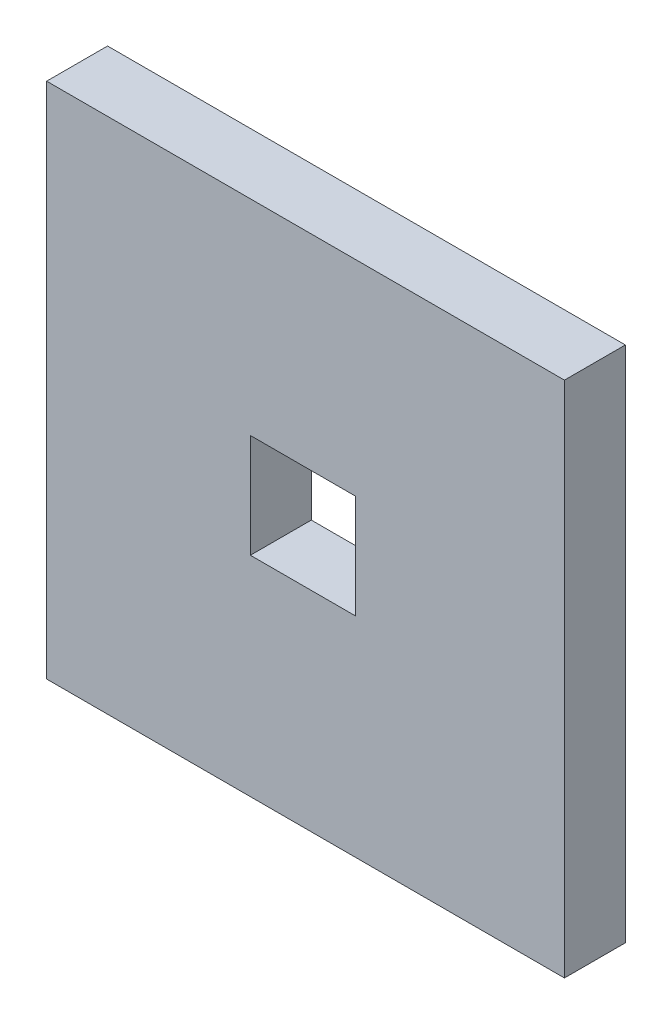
ISO-10303-21;
HEADER;
FILE_DESCRIPTION(('STEP AP214'),'2;1');
FILE_NAME('part.step','',(''),(''),'','','');
FILE_SCHEMA(('AUTOMOTIVE_DESIGN { 1 0 10303 214 1 1 1 1 }'));
ENDSEC;
DATA;
#1=APPLICATION_CONTEXT('core data for automotive mechanical design processes');
#2=APPLICATION_PROTOCOL_DEFINITION('international standard','automotive_design',2000,#1);
#3=PRODUCT_CONTEXT('',#1,'mechanical');
#4=PRODUCT('Part','Part','',(#3));
#5=PRODUCT_RELATED_PRODUCT_CATEGORY('part','',(#4));
#6=PRODUCT_DEFINITION_FORMATION('','',#4);
#7=PRODUCT_DEFINITION_CONTEXT('part definition',#1,'design');
#8=PRODUCT_DEFINITION('design','',#6,#7);
#9=PRODUCT_DEFINITION_SHAPE('','',#8);
#10=(LENGTH_UNIT() NAMED_UNIT(*) SI_UNIT(.MILLI.,.METRE.));
#11=(NAMED_UNIT(*) PLANE_ANGLE_UNIT() SI_UNIT($,.RADIAN.));
#12=(NAMED_UNIT(*) SI_UNIT($,.STERADIAN.) SOLID_ANGLE_UNIT());
#13=UNCERTAINTY_MEASURE_WITH_UNIT(LENGTH_MEASURE(1.E-05),#10,'distance_accuracy_value','');
#14=(GEOMETRIC_REPRESENTATION_CONTEXT(3) GLOBAL_UNCERTAINTY_ASSIGNED_CONTEXT((#13)) GLOBAL_UNIT_ASSIGNED_CONTEXT((#10,
#11,#12)) REPRESENTATION_CONTEXT('',''));
#15=CARTESIAN_POINT('',(0.,0.,0.));
#16=DIRECTION('',(0.,0.,1.));
#17=DIRECTION('',(1.,0.,0.));
#18=AXIS2_PLACEMENT_3D('',#15,#16,#17);
#19=CARTESIAN_POINT('',(-30.6892269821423,0.,99.1665222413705));
#20=DIRECTION('',(1.,0.,0.));
#21=DIRECTION('',(0.,0.,-1.));
#22=AXIS2_PLACEMENT_3D('',#19,#20,#21);
#23=PLANE('',#22);
#24=DIRECTION('',(0.,-1.,0.));
#25=VECTOR('',#24,1.);
#26=CARTESIAN_POINT('',(-30.6892269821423,0.,-5.));
#27=LINE('',#26,#25);
#28=CARTESIAN_POINT('',(-30.6892269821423,-6.80242147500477,-5.));
#29=VERTEX_POINT('',#28);
#30=CARTESIAN_POINT('',(-30.6892269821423,-22.696210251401,-5.));
#31=VERTEX_POINT('',#30);
#32=EDGE_CURVE('E99',#29,#31,#27,.T.);
#33=ORIENTED_EDGE('',*,*,#32,.T.);
#34=DIRECTION('',(0.,0.,1.));
#35=VECTOR('',#34,1.);
#36=CARTESIAN_POINT('',(-30.6892269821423,-22.696210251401,-7.23331795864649));
#37=LINE('',#36,#35);
#38=CARTESIAN_POINT('',(-30.6892269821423,-22.696210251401,0.));
#39=VERTEX_POINT('',#38);
#40=EDGE_CURVE('E315',#31,#39,#37,.T.);
#41=ORIENTED_EDGE('',*,*,#40,.T.);
#42=DIRECTION('',(0.,-1.,0.));
#43=VECTOR('',#42,1.);
#44=CARTESIAN_POINT('',(-30.6892269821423,0.,0.));
#45=LINE('',#44,#43);
#46=CARTESIAN_POINT('',(-30.6892269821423,12.2508497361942,0.));
#47=VERTEX_POINT('',#46);
#48=EDGE_CURVE('E484',#47,#39,#45,.T.);
#49=ORIENTED_EDGE('',*,*,#48,.F.);
#50=DIRECTION('',(0.,0.,1.));
#51=VECTOR('',#50,1.);
#52=CARTESIAN_POINT('',(-30.6892269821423,12.2508497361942,-0.29));
#53=LINE('',#52,#51);
#54=CARTESIAN_POINT('',(-30.6892269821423,12.2508497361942,-0.29));
#55=VERTEX_POINT('',#54);
#56=EDGE_CURVE('E407',#55,#47,#53,.T.);
#57=ORIENTED_EDGE('',*,*,#56,.F.);
#58=DIRECTION('',(0.,1.,0.));
#59=VECTOR('',#58,1.);
#60=CARTESIAN_POINT('',(-30.6892269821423,0.,-0.29));
#61=LINE('',#60,#59);
#62=CARTESIAN_POINT('',(-30.6892269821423,-6.80242147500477,-0.29));
#63=VERTEX_POINT('',#62);
#64=EDGE_CURVE('E398',#63,#55,#61,.T.);
#65=ORIENTED_EDGE('',*,*,#64,.F.);
#66=DIRECTION('',(0.,0.,-1.));
#67=VECTOR('',#66,1.);
#68=CARTESIAN_POINT('',(-30.6892269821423,-6.80242147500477,99.1665222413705));
#69=LINE('',#68,#67);
#70=EDGE_CURVE('E449',#63,#29,#69,.T.);
#71=ORIENTED_EDGE('',*,*,#70,.T.);
#72=EDGE_LOOP('',(#33,#41,#49,#57,#65,#71));
#73=FACE_BOUND('',#72,.T.);
#74=ADVANCED_FACE('F84',(#73),#23,.F.);
#75=CARTESIAN_POINT('',(0.,-6.80242147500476,99.1665222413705));
#76=DIRECTION('',(0.,-1.,0.));
#77=DIRECTION('',(1.,0.,0.));
#78=AXIS2_PLACEMENT_3D('',#75,#76,#77);
#79=PLANE('',#78);
#80=DIRECTION('',(0.,0.,1.));
#81=VECTOR('',#80,1.);
#82=CARTESIAN_POINT('',(-11.2004568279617,-6.8024214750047,-7.23331795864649));
#83=LINE('',#82,#81);
#84=CARTESIAN_POINT('',(-11.2004568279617,-6.80242147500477,-5.));
#85=VERTEX_POINT('',#84);
#86=CARTESIAN_POINT('',(-11.2004568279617,-6.8024214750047,-0.29));
#87=VERTEX_POINT('',#86);
#88=EDGE_CURVE('E318',#85,#87,#83,.T.);
#89=ORIENTED_EDGE('',*,*,#88,.T.);
#90=DIRECTION('',(-1.,0.,0.));
#91=VECTOR('',#90,1.);
#92=CARTESIAN_POINT('',(0.,-6.80242147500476,-0.29));
#93=LINE('',#92,#91);
#94=CARTESIAN_POINT('',(-9.19922698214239,-6.80242147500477,-0.29));
#95=VERTEX_POINT('',#94);
#96=EDGE_CURVE('E401',#95,#87,#93,.T.);
#97=ORIENTED_EDGE('',*,*,#96,.F.);
#98=DIRECTION('',(0.,0.,-1.));
#99=VECTOR('',#98,1.);
#100=CARTESIAN_POINT('',(-9.19922698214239,-6.80242147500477,99.1665222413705));
#101=LINE('',#100,#99);
#102=CARTESIAN_POINT('',(-9.19922698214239,-6.80242147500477,-5.));
#103=VERTEX_POINT('',#102);
#104=EDGE_CURVE('E451',#95,#103,#101,.T.);
#105=ORIENTED_EDGE('',*,*,#104,.T.);
#106=DIRECTION('',(-1.,0.,0.));
#107=VECTOR('',#106,1.);
#108=CARTESIAN_POINT('',(0.,-6.80242147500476,-5.));
#109=LINE('',#108,#107);
#110=EDGE_CURVE('E307',#103,#85,#109,.T.);
#111=ORIENTED_EDGE('',*,*,#110,.T.);
#112=EDGE_LOOP('',(#89,#97,#105,#111));
#113=FACE_BOUND('',#112,.T.);
#114=ADVANCED_FACE('F581',(#113),#79,.F.);
#115=DIRECTION('',(0.,0.,1.));
#116=VECTOR('',#115,1.);
#117=CARTESIAN_POINT('',(-13.1979971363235,-6.8024214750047,-7.23331795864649));
#118=LINE('',#117,#116);
#119=CARTESIAN_POINT('',(-13.1979971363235,-6.80242147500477,-5.));
#120=VERTEX_POINT('',#119);
#121=CARTESIAN_POINT('',(-13.1979971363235,-6.80242147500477,-0.29));
#122=VERTEX_POINT('',#121);
#123=EDGE_CURVE('E321',#120,#122,#118,.T.);
#124=ORIENTED_EDGE('',*,*,#123,.F.);
#125=EDGE_CURVE('E443',#120,#29,#109,.T.);
#126=ORIENTED_EDGE('',*,*,#125,.T.);
#127=ORIENTED_EDGE('',*,*,#70,.F.);
#128=EDGE_CURVE('E400',#122,#63,#93,.T.);
#129=ORIENTED_EDGE('',*,*,#128,.F.);
#130=EDGE_LOOP('',(#124,#126,#127,#129));
#131=FACE_BOUND('',#130,.T.);
#132=ADVANCED_FACE('F589',(#131),#79,.F.);
#133=CARTESIAN_POINT('',(0.,0.,-0.29));
#134=DIRECTION('',(0.,0.,1.));
#135=DIRECTION('',(1.,0.,0.));
#136=AXIS2_PLACEMENT_3D('',#133,#134,#135);
#137=PLANE('',#136);
#138=CARTESIAN_POINT('',(-12.1992269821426,-6.8024214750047,-0.29));
#139=DIRECTION('',(0.,0.,1.));
#140=DIRECTION('',(1.,0.,0.));
#141=AXIS2_PLACEMENT_3D('',#138,#139,#140);
#142=CIRCLE('',#141,0.998770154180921);
#143=EDGE_CURVE('E12',#122,#87,#142,.F.);
#144=ORIENTED_EDGE('',*,*,#143,.F.);
#145=ORIENTED_EDGE('',*,*,#128,.T.);
#146=ORIENTED_EDGE('',*,*,#64,.T.);
#147=DIRECTION('',(1.,0.,0.));
#148=VECTOR('',#147,1.);
#149=CARTESIAN_POINT('',(0.,12.2508497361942,-0.29));
#150=LINE('',#149,#148);
#151=CARTESIAN_POINT('',(10.3708614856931,12.2508497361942,-0.29));
#152=VERTEX_POINT('',#151);
#153=EDGE_CURVE('E395',#55,#152,#150,.T.);
#154=ORIENTED_EDGE('',*,*,#153,.T.);
#155=DIRECTION('',(0.,-1.,0.));
#156=VECTOR('',#155,1.);
#157=CARTESIAN_POINT('',(10.3708614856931,7.25084973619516,-0.29));
#158=LINE('',#157,#156);
#159=CARTESIAN_POINT('',(10.3708614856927,7.25084973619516,-0.29));
#160=VERTEX_POINT('',#159);
#161=EDGE_CURVE('E513',#152,#160,#158,.T.);
#162=ORIENTED_EDGE('',*,*,#161,.T.);
#163=DIRECTION('',(0.,-1.,0.));
#164=VECTOR('',#163,1.);
#165=CARTESIAN_POINT('',(10.3708614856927,0.,-0.29));
#166=LINE('',#165,#164);
#167=CARTESIAN_POINT('',(10.3708614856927,-47.7491502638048,-0.29));
#168=VERTEX_POINT('',#167);
#169=EDGE_CURVE('E392',#160,#168,#166,.T.);
#170=ORIENTED_EDGE('',*,*,#169,.T.);
#171=DIRECTION('',(-1.,0.,0.));
#172=VECTOR('',#171,1.);
#173=CARTESIAN_POINT('',(5.37086148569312,-47.7491502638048,-0.29));
#174=LINE('',#173,#172);
#175=CARTESIAN_POINT('',(5.37086148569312,-47.7491502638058,-0.29));
#176=VERTEX_POINT('',#175);
#177=EDGE_CURVE('E510',#168,#176,#174,.T.);
#178=ORIENTED_EDGE('',*,*,#177,.T.);
#179=DIRECTION('',(1.,0.,0.));
#180=VECTOR('',#179,1.);
#181=CARTESIAN_POINT('',(0.,-47.7491502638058,-0.29));
#182=LINE('',#181,#180);
#183=CARTESIAN_POINT('',(-30.6892269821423,-47.7491502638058,-0.29));
#184=VERTEX_POINT('',#183);
#185=EDGE_CURVE('E389',#184,#176,#182,.T.);
#186=ORIENTED_EDGE('',*,*,#185,.F.);
#187=DIRECTION('',(0.,-1.,0.));
#188=VECTOR('',#187,1.);
#189=CARTESIAN_POINT('',(-30.6892269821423,0.,-0.29));
#190=LINE('',#189,#188);
#191=CARTESIAN_POINT('',(-30.6892269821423,-28.2927907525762,-0.29));
#192=VERTEX_POINT('',#191);
#193=EDGE_CURVE('E386',#192,#184,#190,.T.);
#194=ORIENTED_EDGE('',*,*,#193,.F.);
#195=DIRECTION('',(-1.,0.,0.));
#196=VECTOR('',#195,1.);
#197=CARTESIAN_POINT('',(0.,-28.2927907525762,-0.29));
#198=LINE('',#197,#196);
#199=CARTESIAN_POINT('',(-9.19922698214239,-28.2927907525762,-0.289999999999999));
#200=VERTEX_POINT('',#199);
#201=EDGE_CURVE('E383',#200,#192,#198,.T.);
#202=ORIENTED_EDGE('',*,*,#201,.F.);
#203=DIRECTION('',(0.,-1.,0.));
#204=VECTOR('',#203,1.);
#205=CARTESIAN_POINT('',(-9.19922698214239,0.,-0.29));
#206=LINE('',#205,#204);
#207=EDGE_CURVE('E403',#95,#200,#206,.T.);
#208=ORIENTED_EDGE('',*,*,#207,.F.);
#209=ORIENTED_EDGE('',*,*,#96,.T.);
#210=EDGE_LOOP('',(#144,#145,#146,#154,#162,#170,#178,#186,#194,#202,#208,#209));
#211=FACE_BOUND('',#210,.T.);
#212=ADVANCED_FACE('F552',(#211),#137,.F.);
#213=CARTESIAN_POINT('',(0.,0.,-5.));
#214=DIRECTION('',(0.,0.,1.));
#215=DIRECTION('',(1.,0.,0.));
#216=AXIS2_PLACEMENT_3D('',#213,#214,#215);
#217=PLANE('',#216);
#218=DIRECTION('',(0.,-1.,0.));
#219=VECTOR('',#218,1.);
#220=CARTESIAN_POINT('',(14.3708614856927,0.,-5.));
#221=LINE('',#220,#219);
#222=CARTESIAN_POINT('',(14.3708614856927,16.2508497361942,-5.));
#223=VERTEX_POINT('',#222);
#224=CARTESIAN_POINT('',(14.3708614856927,-51.7491502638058,-5.));
#225=VERTEX_POINT('',#224);
#226=EDGE_CURVE('E456',#223,#225,#221,.T.);
#227=ORIENTED_EDGE('',*,*,#226,.T.);
#228=DIRECTION('',(1.,0.,0.));
#229=VECTOR('',#228,1.);
#230=CARTESIAN_POINT('',(0.,-51.7491502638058,-5.));
#231=LINE('',#230,#229);
#232=CARTESIAN_POINT('',(-53.6291385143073,-51.7491502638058,-5.));
#233=VERTEX_POINT('',#232);
#234=EDGE_CURVE('E465',#233,#225,#231,.T.);
#235=ORIENTED_EDGE('',*,*,#234,.F.);
#236=DIRECTION('',(0.,-1.,0.));
#237=VECTOR('',#236,1.);
#238=CARTESIAN_POINT('',(-53.6291385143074,0.,-5.));
#239=LINE('',#238,#237);
#240=CARTESIAN_POINT('',(-53.6291385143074,16.2508497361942,-5.));
#241=VERTEX_POINT('',#240);
#242=EDGE_CURVE('E462',#241,#233,#239,.T.);
#243=ORIENTED_EDGE('',*,*,#242,.F.);
#244=DIRECTION('',(1.,0.,0.));
#245=VECTOR('',#244,1.);
#246=CARTESIAN_POINT('',(0.,16.2508497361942,-5.));
#247=LINE('',#246,#245);
#248=EDGE_CURVE('E459',#241,#223,#247,.T.);
#249=ORIENTED_EDGE('',*,*,#248,.T.);
#250=EDGE_LOOP('',(#227,#235,#243,#249));
#251=FACE_BOUND('',#250,.T.);
#252=DIRECTION('',(-1.,0.,0.));
#253=VECTOR('',#252,1.);
#254=CARTESIAN_POINT('',(0.,-42.7491502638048,-5.));
#255=LINE('',#254,#253);
#256=CARTESIAN_POINT('',(-49.6291385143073,-42.7491502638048,-5.));
#257=VERTEX_POINT('',#256);
#258=CARTESIAN_POINT('',(-51.6291385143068,-42.7491502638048,-5.));
#259=VERTEX_POINT('',#258);
#260=EDGE_CURVE('E332',#257,#259,#255,.T.);
#261=ORIENTED_EDGE('',*,*,#260,.T.);
#262=DIRECTION('',(0.,1.,0.));
#263=VECTOR('',#262,1.);
#264=CARTESIAN_POINT('',(-51.6291385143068,0.,-5.));
#265=LINE('',#264,#263);
#266=CARTESIAN_POINT('',(-51.6291385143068,-47.7491502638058,-5.));
#267=VERTEX_POINT('',#266);
#268=EDGE_CURVE('E331',#267,#259,#265,.T.);
#269=ORIENTED_EDGE('',*,*,#268,.F.);
#270=DIRECTION('',(1.,0.,0.));
#271=VECTOR('',#270,1.);
#272=CARTESIAN_POINT('',(0.,-47.7491502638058,-5.));
#273=LINE('',#272,#271);
#274=CARTESIAN_POINT('',(5.37086148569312,-47.7491502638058,-5.));
#275=VERTEX_POINT('',#274);
#276=EDGE_CURVE('E474',#267,#275,#273,.T.);
#277=ORIENTED_EDGE('',*,*,#276,.T.);
#278=DIRECTION('',(0.,-1.,0.));
#279=VECTOR('',#278,1.);
#280=CARTESIAN_POINT('',(5.37086148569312,0.,-5.));
#281=LINE('',#280,#279);
#282=CARTESIAN_POINT('',(5.37086148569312,-49.7491502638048,-5.));
#283=VERTEX_POINT('',#282);
#284=EDGE_CURVE('E361',#275,#283,#281,.T.);
#285=ORIENTED_EDGE('',*,*,#284,.T.);
#286=DIRECTION('',(-1.,0.,0.));
#287=VECTOR('',#286,1.);
#288=CARTESIAN_POINT('',(0.,-49.7491502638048,-5.));
#289=LINE('',#288,#287);
#290=CARTESIAN_POINT('',(10.3708614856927,-49.7491502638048,-5.));
#291=VERTEX_POINT('',#290);
#292=EDGE_CURVE('E351',#291,#283,#289,.T.);
#293=ORIENTED_EDGE('',*,*,#292,.F.);
#294=DIRECTION('',(0.,-1.,0.));
#295=VECTOR('',#294,1.);
#296=CARTESIAN_POINT('',(10.3708614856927,0.,-5.));
#297=LINE('',#296,#295);
#298=CARTESIAN_POINT('',(10.3708614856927,7.25084973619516,-5.));
#299=VERTEX_POINT('',#298);
#300=EDGE_CURVE('E471',#299,#291,#297,.T.);
#301=ORIENTED_EDGE('',*,*,#300,.F.);
#302=DIRECTION('',(1.,0.,0.));
#303=VECTOR('',#302,1.);
#304=CARTESIAN_POINT('',(0.,7.25084973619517,-5.));
#305=LINE('',#304,#303);
#306=CARTESIAN_POINT('',(12.3708614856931,7.25084973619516,-5.));
#307=VERTEX_POINT('',#306);
#308=EDGE_CURVE('E371',#299,#307,#305,.T.);
#309=ORIENTED_EDGE('',*,*,#308,.T.);
#310=DIRECTION('',(0.,-1.,0.));
#311=VECTOR('',#310,1.);
#312=CARTESIAN_POINT('',(12.3708614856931,0.,-5.));
#313=LINE('',#312,#311);
#314=CARTESIAN_POINT('',(12.3708614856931,12.2508497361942,-5.));
#315=VERTEX_POINT('',#314);
#316=EDGE_CURVE('E364',#315,#307,#313,.T.);
#317=ORIENTED_EDGE('',*,*,#316,.F.);
#318=DIRECTION('',(1.,0.,0.));
#319=VECTOR('',#318,1.);
#320=CARTESIAN_POINT('',(0.,12.2508497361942,-5.));
#321=LINE('',#320,#319);
#322=CARTESIAN_POINT('',(-44.6291385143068,12.2508497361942,-5.));
#323=VERTEX_POINT('',#322);
#324=EDGE_CURVE('E468',#323,#315,#321,.T.);
#325=ORIENTED_EDGE('',*,*,#324,.F.);
#326=DIRECTION('',(0.,1.,0.));
#327=VECTOR('',#326,1.);
#328=CARTESIAN_POINT('',(-44.6291385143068,0.,-5.));
#329=LINE('',#328,#327);
#330=CARTESIAN_POINT('',(-44.6291385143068,14.2508497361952,-5.));
#331=VERTEX_POINT('',#330);
#332=EDGE_CURVE('E348',#323,#331,#329,.T.);
#333=ORIENTED_EDGE('',*,*,#332,.T.);
#334=DIRECTION('',(1.,0.,0.));
#335=VECTOR('',#334,1.);
#336=CARTESIAN_POINT('',(0.,14.2508497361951,-5.));
#337=LINE('',#336,#335);
#338=CARTESIAN_POINT('',(-49.6291385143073,14.2508497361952,-5.));
#339=VERTEX_POINT('',#338);
#340=EDGE_CURVE('E344',#339,#331,#337,.T.);
#341=ORIENTED_EDGE('',*,*,#340,.F.);
#342=DIRECTION('',(0.,-1.,0.));
#343=VECTOR('',#342,1.);
#344=CARTESIAN_POINT('',(-49.6291385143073,0.,-5.));
#345=LINE('',#344,#343);
#346=EDGE_CURVE('E477',#339,#257,#345,.T.);
#347=ORIENTED_EDGE('',*,*,#346,.T.);
#348=EDGE_LOOP('',(#261,#269,#277,#285,#293,#301,#309,#317,#325,#333,#341,#347));
#349=FACE_BOUND('',#348,.T.);
#350=ADVANCED_FACE('F564',(#251,#349),#217,.F.);
#351=CARTESIAN_POINT('',(-49.6291385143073,0.,99.1665222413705));
#352=DIRECTION('',(1.,0.,0.));
#353=DIRECTION('',(0.,1.,0.));
#354=AXIS2_PLACEMENT_3D('',#351,#352,#353);
#355=PLANE('',#354);
#356=DIRECTION('',(0.,0.,-1.));
#357=VECTOR('',#356,1.);
#358=CARTESIAN_POINT('',(-49.6291385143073,14.2508497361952,5.38516480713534));
#359=LINE('',#358,#357);
#360=CARTESIAN_POINT('',(-49.6291385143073,14.2508497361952,-2.));
#361=VERTEX_POINT('',#360);
#362=EDGE_CURVE('E347',#361,#339,#359,.T.);
#363=ORIENTED_EDGE('',*,*,#362,.F.);
#364=CARTESIAN_POINT('',(-49.6291385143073,12.2508497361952,-2.));
#365=DIRECTION('',(1.,0.,0.));
#366=DIRECTION('',(0.,1.,0.));
#367=AXIS2_PLACEMENT_3D('',#364,#365,#366);
#368=CIRCLE('',#367,2.);
#369=CARTESIAN_POINT('',(-49.6291385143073,12.2508497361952,0.));
#370=VERTEX_POINT('',#369);
#371=EDGE_CURVE('E532',#361,#370,#368,.T.);
#372=ORIENTED_EDGE('',*,*,#371,.T.);
#373=DIRECTION('',(0.,1.,0.));
#374=VECTOR('',#373,1.);
#375=CARTESIAN_POINT('',(-49.6291385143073,0.,0.));
#376=LINE('',#375,#374);
#377=CARTESIAN_POINT('',(-49.6291385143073,-42.7491502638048,0.));
#378=VERTEX_POINT('',#377);
#379=EDGE_CURVE('E507',#378,#370,#376,.T.);
#380=ORIENTED_EDGE('',*,*,#379,.F.);
#381=DIRECTION('',(0.,0.,-1.));
#382=VECTOR('',#381,1.);
#383=CARTESIAN_POINT('',(-49.6291385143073,-42.7491502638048,5.38516480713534));
#384=LINE('',#383,#382);
#385=EDGE_CURVE('E336',#378,#257,#384,.T.);
#386=ORIENTED_EDGE('',*,*,#385,.T.);
#387=ORIENTED_EDGE('',*,*,#346,.F.);
#388=EDGE_LOOP('',(#363,#372,#380,#386,#387));
#389=FACE_BOUND('',#388,.T.);
#390=ADVANCED_FACE('F620',(#389),#355,.T.);
#391=CARTESIAN_POINT('',(0.,12.2508497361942,99.1665222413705));
#392=DIRECTION('',(0.,1.,0.));
#393=DIRECTION('',(0.,0.,1.));
#394=AXIS2_PLACEMENT_3D('',#391,#392,#393);
#395=PLANE('',#394);
#396=DIRECTION('',(0.,0.,-1.));
#397=VECTOR('',#396,1.);
#398=CARTESIAN_POINT('',(12.3708614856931,12.2508497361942,5.09516480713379));
#399=LINE('',#398,#397);
#400=CARTESIAN_POINT('',(12.3708614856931,12.2508497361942,-2.29));
#401=VERTEX_POINT('',#400);
#402=EDGE_CURVE('E374',#401,#315,#399,.T.);
#403=ORIENTED_EDGE('',*,*,#402,.F.);
#404=CARTESIAN_POINT('',(10.3708614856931,12.2508497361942,-2.29));
#405=DIRECTION('',(0.,1.,0.));
#406=DIRECTION('',(0.,0.,1.));
#407=AXIS2_PLACEMENT_3D('',#404,#405,#406);
#408=CIRCLE('',#407,2.);
#409=EDGE_CURVE('E520',#401,#152,#408,.F.);
#410=ORIENTED_EDGE('',*,*,#409,.T.);
#411=ORIENTED_EDGE('',*,*,#153,.F.);
#412=ORIENTED_EDGE('',*,*,#56,.T.);
#413=DIRECTION('',(-1.,0.,0.));
#414=VECTOR('',#413,1.);
#415=CARTESIAN_POINT('',(0.,12.2508497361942,0.));
#416=LINE('',#415,#414);
#417=CARTESIAN_POINT('',(-44.6291385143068,12.2508497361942,0.));
#418=VERTEX_POINT('',#417);
#419=EDGE_CURVE('E501',#47,#418,#416,.T.);
#420=ORIENTED_EDGE('',*,*,#419,.T.);
#421=DIRECTION('',(0.,0.,-1.));
#422=VECTOR('',#421,1.);
#423=CARTESIAN_POINT('',(-44.6291385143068,12.2508497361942,5.38516480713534));
#424=LINE('',#423,#422);
#425=EDGE_CURVE('E352',#418,#323,#424,.T.);
#426=ORIENTED_EDGE('',*,*,#425,.T.);
#427=ORIENTED_EDGE('',*,*,#324,.T.);
#428=EDGE_LOOP('',(#403,#410,#411,#412,#420,#426,#427));
#429=FACE_BOUND('',#428,.T.);
#430=ADVANCED_FACE('F608',(#429),#395,.F.);
#431=CARTESIAN_POINT('',(0.,-47.7491502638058,99.1665222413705));
#432=DIRECTION('',(0.,1.,0.));
#433=DIRECTION('',(0.,0.,1.));
#434=AXIS2_PLACEMENT_3D('',#431,#432,#433);
#435=PLANE('',#434);
#436=DIRECTION('',(0.,0.,-1.));
#437=VECTOR('',#436,1.);
#438=CARTESIAN_POINT('',(-51.6291385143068,-47.7491502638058,5.38516480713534));
#439=LINE('',#438,#437);
#440=CARTESIAN_POINT('',(-51.6291385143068,-47.7491502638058,-2.));
#441=VERTEX_POINT('',#440);
#442=EDGE_CURVE('E335',#441,#267,#439,.T.);
#443=ORIENTED_EDGE('',*,*,#442,.F.);
#444=CARTESIAN_POINT('',(-49.6291385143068,-47.7491502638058,-2.));
#445=DIRECTION('',(0.,1.,0.));
#446=DIRECTION('',(0.,0.,1.));
#447=AXIS2_PLACEMENT_3D('',#444,#445,#446);
#448=CIRCLE('',#447,2.);
#449=CARTESIAN_POINT('',(-49.6291385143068,-47.7491502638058,0.));
#450=VERTEX_POINT('',#449);
#451=EDGE_CURVE('E538',#441,#450,#448,.T.);
#452=ORIENTED_EDGE('',*,*,#451,.T.);
#453=DIRECTION('',(-1.,0.,0.));
#454=VECTOR('',#453,1.);
#455=CARTESIAN_POINT('',(0.,-47.7491502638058,0.));
#456=LINE('',#455,#454);
#457=CARTESIAN_POINT('',(-30.6892269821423,-47.7491502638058,0.));
#458=VERTEX_POINT('',#457);
#459=EDGE_CURVE('E504',#458,#450,#456,.T.);
#460=ORIENTED_EDGE('',*,*,#459,.F.);
#461=DIRECTION('',(0.,0.,1.));
#462=VECTOR('',#461,1.);
#463=CARTESIAN_POINT('',(-30.6892269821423,-47.7491502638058,-0.29));
#464=LINE('',#463,#462);
#465=EDGE_CURVE('E406',#184,#458,#464,.T.);
#466=ORIENTED_EDGE('',*,*,#465,.F.);
#467=ORIENTED_EDGE('',*,*,#185,.T.);
#468=DIRECTION('',(0.,0.,-1.));
#469=VECTOR('',#468,1.);
#470=CARTESIAN_POINT('',(5.37086148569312,-47.7491502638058,5.09516480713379));
#471=LINE('',#470,#469);
#472=EDGE_CURVE('E365',#176,#275,#471,.T.);
#473=ORIENTED_EDGE('',*,*,#472,.T.);
#474=ORIENTED_EDGE('',*,*,#276,.F.);
#475=EDGE_LOOP('',(#443,#452,#460,#466,#467,#473,#474));
#476=FACE_BOUND('',#475,.T.);
#477=ADVANCED_FACE('F569',(#476),#435,.T.);
#478=CARTESIAN_POINT('',(10.3708614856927,0.,99.1665222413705));
#479=DIRECTION('',(1.,0.,0.));
#480=DIRECTION('',(0.,1.,0.));
#481=AXIS2_PLACEMENT_3D('',#478,#479,#480);
#482=PLANE('',#481);
#483=DIRECTION('',(0.,0.,-1.));
#484=VECTOR('',#483,1.);
#485=CARTESIAN_POINT('',(10.3708614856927,-49.7491502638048,5.09516480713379));
#486=LINE('',#485,#484);
#487=CARTESIAN_POINT('',(10.3708614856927,-49.7491502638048,-2.29));
#488=VERTEX_POINT('',#487);
#489=EDGE_CURVE('E360',#488,#291,#486,.T.);
#490=ORIENTED_EDGE('',*,*,#489,.F.);
#491=CARTESIAN_POINT('',(10.3708614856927,-47.7491502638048,-2.29));
#492=DIRECTION('',(1.,0.,0.));
#493=DIRECTION('',(0.,1.,0.));
#494=AXIS2_PLACEMENT_3D('',#491,#492,#493);
#495=CIRCLE('',#494,2.);
#496=EDGE_CURVE('E92',#488,#168,#495,.F.);
#497=ORIENTED_EDGE('',*,*,#496,.T.);
#498=ORIENTED_EDGE('',*,*,#169,.F.);
#499=DIRECTION('',(0.,0.,-1.));
#500=VECTOR('',#499,1.);
#501=CARTESIAN_POINT('',(10.3708614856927,7.25084973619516,5.09516480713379));
#502=LINE('',#501,#500);
#503=EDGE_CURVE('E375',#160,#299,#502,.T.);
#504=ORIENTED_EDGE('',*,*,#503,.T.);
#505=ORIENTED_EDGE('',*,*,#300,.T.);
#506=EDGE_LOOP('',(#490,#497,#498,#504,#505));
#507=FACE_BOUND('',#506,.T.);
#508=ADVANCED_FACE('F547',(#507),#482,.F.);
#509=CARTESIAN_POINT('',(0.,0.,0.));
#510=DIRECTION('',(0.,0.,1.));
#511=DIRECTION('',(1.,0.,0.));
#512=AXIS2_PLACEMENT_3D('',#509,#510,#511);
#513=PLANE('',#512);
#514=ORIENTED_EDGE('',*,*,#48,.T.);
#515=CARTESIAN_POINT('',(-30.6892269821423,-23.692790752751,0.));
#516=DIRECTION('',(0.,0.,-1.));
#517=DIRECTION('',(-1.,0.,0.));
#518=AXIS2_PLACEMENT_3D('',#515,#516,#517);
#519=CIRCLE('',#518,0.996580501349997);
#520=CARTESIAN_POINT('',(-30.6892269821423,-24.689371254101,0.));
#521=VERTEX_POINT('',#520);
#522=EDGE_CURVE('E107',#39,#521,#519,.F.);
#523=ORIENTED_EDGE('',*,*,#522,.T.);
#524=EDGE_CURVE('E313',#521,#458,#45,.T.);
#525=ORIENTED_EDGE('',*,*,#524,.T.);
#526=ORIENTED_EDGE('',*,*,#459,.T.);
#527=DIRECTION('',(0.,1.,0.));
#528=VECTOR('',#527,1.);
#529=CARTESIAN_POINT('',(-49.6291385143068,-42.7491502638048,0.));
#530=LINE('',#529,#528);
#531=EDGE_CURVE('E522',#450,#378,#530,.T.);
#532=ORIENTED_EDGE('',*,*,#531,.T.);
#533=ORIENTED_EDGE('',*,*,#379,.T.);
#534=DIRECTION('',(1.,0.,0.));
#535=VECTOR('',#534,1.);
#536=CARTESIAN_POINT('',(-44.6291385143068,12.2508497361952,0.));
#537=LINE('',#536,#535);
#538=EDGE_CURVE('E525',#370,#418,#537,.T.);
#539=ORIENTED_EDGE('',*,*,#538,.T.);
#540=ORIENTED_EDGE('',*,*,#419,.F.);
#541=EDGE_LOOP('',(#514,#523,#525,#526,#532,#533,#539,#540));
#542=FACE_BOUND('',#541,.T.);
#543=ADVANCED_FACE('F634',(#542),#513,.F.);
#544=CARTESIAN_POINT('',(0.,-28.2927907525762,99.1665222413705));
#545=DIRECTION('',(0.,-1.,0.));
#546=DIRECTION('',(1.,0.,0.));
#547=AXIS2_PLACEMENT_3D('',#544,#545,#546);
#548=PLANE('',#547);
#549=DIRECTION('',(0.,0.,-1.));
#550=VECTOR('',#549,1.);
#551=CARTESIAN_POINT('',(-9.19922698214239,-28.2927907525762,99.1665222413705));
#552=LINE('',#551,#550);
#553=CARTESIAN_POINT('',(-9.19922698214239,-28.2927907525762,-5.));
#554=VERTEX_POINT('',#553);
#555=EDGE_CURVE('E448',#200,#554,#552,.T.);
#556=ORIENTED_EDGE('',*,*,#555,.F.);
#557=ORIENTED_EDGE('',*,*,#201,.T.);
#558=DIRECTION('',(0.,0.,-1.));
#559=VECTOR('',#558,1.);
#560=CARTESIAN_POINT('',(-30.6892269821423,-28.2927907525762,99.1665222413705));
#561=LINE('',#560,#559);
#562=CARTESIAN_POINT('',(-30.6892269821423,-28.2927907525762,-5.));
#563=VERTEX_POINT('',#562);
#564=EDGE_CURVE('E452',#192,#563,#561,.T.);
#565=ORIENTED_EDGE('',*,*,#564,.T.);
#566=DIRECTION('',(-1.,0.,0.));
#567=VECTOR('',#566,1.);
#568=CARTESIAN_POINT('',(0.,-28.2927907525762,-5.));
#569=LINE('',#568,#567);
#570=EDGE_CURVE('E303',#554,#563,#569,.T.);
#571=ORIENTED_EDGE('',*,*,#570,.F.);
#572=EDGE_LOOP('',(#556,#557,#565,#571));
#573=FACE_BOUND('',#572,.T.);
#574=ADVANCED_FACE('F574',(#573),#548,.T.);
#575=CARTESIAN_POINT('',(-9.19922698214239,0.,99.1665222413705));
#576=DIRECTION('',(1.,0.,0.));
#577=DIRECTION('',(0.,1.,0.));
#578=AXIS2_PLACEMENT_3D('',#575,#576,#577);
#579=PLANE('',#578);
#580=ORIENTED_EDGE('',*,*,#104,.F.);
#581=ORIENTED_EDGE('',*,*,#207,.T.);
#582=ORIENTED_EDGE('',*,*,#555,.T.);
#583=DIRECTION('',(0.,-1.,0.));
#584=VECTOR('',#583,1.);
#585=CARTESIAN_POINT('',(-9.19922698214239,0.,-5.));
#586=LINE('',#585,#584);
#587=EDGE_CURVE('E446',#103,#554,#586,.T.);
#588=ORIENTED_EDGE('',*,*,#587,.F.);
#589=EDGE_LOOP('',(#580,#581,#582,#588));
#590=FACE_BOUND('',#589,.T.);
#591=ADVANCED_FACE('F578',(#590),#579,.T.);
#592=CARTESIAN_POINT('',(14.3708614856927,0.,3.));
#593=DIRECTION('',(1.,0.,0.));
#594=DIRECTION('',(0.,1.,0.));
#595=AXIS2_PLACEMENT_3D('',#592,#593,#594);
#596=PLANE('',#595);
#597=DIRECTION('',(0.,0.,-1.));
#598=VECTOR('',#597,1.);
#599=CARTESIAN_POINT('',(14.3708614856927,-51.7491502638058,3.));
#600=LINE('',#599,#598);
#601=CARTESIAN_POINT('',(14.3708614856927,-51.7491502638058,3.));
#602=VERTEX_POINT('',#601);
#603=EDGE_CURVE('E492',#602,#225,#600,.T.);
#604=ORIENTED_EDGE('',*,*,#603,.T.);
#605=ORIENTED_EDGE('',*,*,#226,.F.);
#606=DIRECTION('',(0.,0.,-1.));
#607=VECTOR('',#606,1.);
#608=CARTESIAN_POINT('',(14.3708614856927,16.2508497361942,3.));
#609=LINE('',#608,#607);
#610=CARTESIAN_POINT('',(14.3708614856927,16.2508497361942,3.));
#611=VERTEX_POINT('',#610);
#612=EDGE_CURVE('E499',#611,#223,#609,.T.);
#613=ORIENTED_EDGE('',*,*,#612,.F.);
#614=DIRECTION('',(0.,-1.,0.));
#615=VECTOR('',#614,1.);
#616=CARTESIAN_POINT('',(14.3708614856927,0.,3.));
#617=LINE('',#616,#615);
#618=EDGE_CURVE('E480',#611,#602,#617,.T.);
#619=ORIENTED_EDGE('',*,*,#618,.T.);
#620=EDGE_LOOP('',(#604,#605,#613,#619));
#621=FACE_BOUND('',#620,.T.);
#622=ADVANCED_FACE('F833',(#621),#596,.T.);
#623=CARTESIAN_POINT('',(0.,16.2508497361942,3.));
#624=DIRECTION('',(0.,1.,0.));
#625=DIRECTION('',(0.,0.,1.));
#626=AXIS2_PLACEMENT_3D('',#623,#624,#625);
#627=PLANE('',#626);
#628=ORIENTED_EDGE('',*,*,#612,.T.);
#629=ORIENTED_EDGE('',*,*,#248,.F.);
#630=DIRECTION('',(0.,0.,-1.));
#631=VECTOR('',#630,1.);
#632=CARTESIAN_POINT('',(-53.6291385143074,16.2508497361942,3.));
#633=LINE('',#632,#631);
#634=CARTESIAN_POINT('',(-53.6291385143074,16.2508497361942,3.));
#635=VERTEX_POINT('',#634);
#636=EDGE_CURVE('E497',#635,#241,#633,.T.);
#637=ORIENTED_EDGE('',*,*,#636,.F.);
#638=DIRECTION('',(1.,0.,0.));
#639=VECTOR('',#638,1.);
#640=CARTESIAN_POINT('',(0.,16.2508497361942,3.));
#641=LINE('',#640,#639);
#642=EDGE_CURVE('E483',#635,#611,#641,.T.);
#643=ORIENTED_EDGE('',*,*,#642,.T.);
#644=EDGE_LOOP('',(#628,#629,#637,#643));
#645=FACE_BOUND('',#644,.T.);
#646=ADVANCED_FACE('F895',(#645),#627,.T.);
#647=CARTESIAN_POINT('',(-53.6291385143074,0.,3.));
#648=DIRECTION('',(1.,0.,0.));
#649=DIRECTION('',(0.,1.,0.));
#650=AXIS2_PLACEMENT_3D('',#647,#648,#649);
#651=PLANE('',#650);
#652=ORIENTED_EDGE('',*,*,#636,.T.);
#653=ORIENTED_EDGE('',*,*,#242,.T.);
#654=DIRECTION('',(0.,0.,-1.));
#655=VECTOR('',#654,1.);
#656=CARTESIAN_POINT('',(-53.6291385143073,-51.7491502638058,3.));
#657=LINE('',#656,#655);
#658=CARTESIAN_POINT('',(-53.6291385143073,-51.7491502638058,3.));
#659=VERTEX_POINT('',#658);
#660=EDGE_CURVE('E495',#659,#233,#657,.T.);
#661=ORIENTED_EDGE('',*,*,#660,.F.);
#662=DIRECTION('',(0.,-1.,0.));
#663=VECTOR('',#662,1.);
#664=CARTESIAN_POINT('',(-53.6291385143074,0.,3.));
#665=LINE('',#664,#663);
#666=EDGE_CURVE('E487',#635,#659,#665,.T.);
#667=ORIENTED_EDGE('',*,*,#666,.F.);
#668=EDGE_LOOP('',(#652,#653,#661,#667));
#669=FACE_BOUND('',#668,.T.);
#670=ADVANCED_FACE('F884',(#669),#651,.F.);
#671=CARTESIAN_POINT('',(0.,-51.7491502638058,3.));
#672=DIRECTION('',(0.,1.,0.));
#673=DIRECTION('',(0.,0.,1.));
#674=AXIS2_PLACEMENT_3D('',#671,#672,#673);
#675=PLANE('',#674);
#676=ORIENTED_EDGE('',*,*,#660,.T.);
#677=ORIENTED_EDGE('',*,*,#234,.T.);
#678=ORIENTED_EDGE('',*,*,#603,.F.);
#679=DIRECTION('',(1.,0.,0.));
#680=VECTOR('',#679,1.);
#681=CARTESIAN_POINT('',(0.,-51.7491502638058,3.));
#682=LINE('',#681,#680);
#683=EDGE_CURVE('E490',#659,#602,#682,.T.);
#684=ORIENTED_EDGE('',*,*,#683,.F.);
#685=EDGE_LOOP('',(#676,#677,#678,#684));
#686=FACE_BOUND('',#685,.T.);
#687=ADVANCED_FACE('F667',(#686),#675,.F.);
#688=CARTESIAN_POINT('',(0.,0.,3.));
#689=DIRECTION('',(0.,0.,1.));
#690=DIRECTION('',(1.,0.,0.));
#691=AXIS2_PLACEMENT_3D('',#688,#689,#690);
#692=PLANE('',#691);
#693=DIRECTION('',(0.,-1.,0.));
#694=VECTOR('',#693,1.);
#695=CARTESIAN_POINT('',(-13.0936757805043,-10.6664744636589,3.));
#696=LINE('',#695,#694);
#697=CARTESIAN_POINT('',(-13.0936757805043,-10.6664744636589,3.));
#698=VERTEX_POINT('',#697);
#699=CARTESIAN_POINT('',(-13.0936757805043,-24.2901708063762,3.));
#700=VERTEX_POINT('',#699);
#701=EDGE_CURVE('E417',#698,#700,#696,.T.);
#702=ORIENTED_EDGE('',*,*,#701,.T.);
#703=DIRECTION('',(-1.,0.,0.));
#704=VECTOR('',#703,1.);
#705=CARTESIAN_POINT('',(-13.0936757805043,-24.2901708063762,3.));
#706=LINE('',#705,#704);
#707=CARTESIAN_POINT('',(-26.8721868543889,-24.2901708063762,3.));
#708=VERTEX_POINT('',#707);
#709=EDGE_CURVE('E434',#700,#708,#706,.T.);
#710=ORIENTED_EDGE('',*,*,#709,.T.);
#711=DIRECTION('',(0.,1.,0.));
#712=VECTOR('',#711,1.);
#713=CARTESIAN_POINT('',(-26.8721868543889,-10.6664744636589,3.));
#714=LINE('',#713,#712);
#715=CARTESIAN_POINT('',(-26.8721868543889,-10.6664744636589,3.));
#716=VERTEX_POINT('',#715);
#717=EDGE_CURVE('E410',#708,#716,#714,.T.);
#718=ORIENTED_EDGE('',*,*,#717,.T.);
#719=DIRECTION('',(1.,0.,0.));
#720=VECTOR('',#719,1.);
#721=CARTESIAN_POINT('',(-13.0936757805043,-10.6664744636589,3.));
#722=LINE('',#721,#720);
#723=EDGE_CURVE('E414',#716,#698,#722,.T.);
#724=ORIENTED_EDGE('',*,*,#723,.T.);
#725=EDGE_LOOP('',(#702,#710,#718,#724));
#726=FACE_BOUND('',#725,.T.);
#727=ORIENTED_EDGE('',*,*,#618,.F.);
#728=ORIENTED_EDGE('',*,*,#642,.F.);
#729=ORIENTED_EDGE('',*,*,#666,.T.);
#730=ORIENTED_EDGE('',*,*,#683,.T.);
#731=EDGE_LOOP('',(#727,#728,#729,#730));
#732=FACE_BOUND('',#731,.T.);
#733=ADVANCED_FACE('F661',(#726,#732),#692,.T.);
#734=CARTESIAN_POINT('',(0.,0.,-5.));
#735=DIRECTION('',(0.,0.,1.));
#736=DIRECTION('',(1.,0.,0.));
#737=AXIS2_PLACEMENT_3D('',#734,#735,#736);
#738=PLANE('',#737);
#739=DIRECTION('',(-1.,0.,0.));
#740=VECTOR('',#739,1.);
#741=CARTESIAN_POINT('',(-13.0936757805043,-24.2901708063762,-5.));
#742=LINE('',#741,#740);
#743=CARTESIAN_POINT('',(-13.0936757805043,-24.2901708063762,-5.));
#744=VERTEX_POINT('',#743);
#745=CARTESIAN_POINT('',(-26.8721868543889,-24.2901708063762,-5.));
#746=VERTEX_POINT('',#745);
#747=EDGE_CURVE('E422',#744,#746,#742,.T.);
#748=ORIENTED_EDGE('',*,*,#747,.F.);
#749=DIRECTION('',(0.,-1.,0.));
#750=VECTOR('',#749,1.);
#751=CARTESIAN_POINT('',(-13.0936757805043,-10.6664744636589,-5.));
#752=LINE('',#751,#750);
#753=CARTESIAN_POINT('',(-13.0936757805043,-10.6664744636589,-5.));
#754=VERTEX_POINT('',#753);
#755=EDGE_CURVE('E420',#754,#744,#752,.T.);
#756=ORIENTED_EDGE('',*,*,#755,.F.);
#757=DIRECTION('',(1.,0.,0.));
#758=VECTOR('',#757,1.);
#759=CARTESIAN_POINT('',(-13.0936757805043,-10.6664744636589,-5.));
#760=LINE('',#759,#758);
#761=CARTESIAN_POINT('',(-26.8721868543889,-10.6664744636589,-5.));
#762=VERTEX_POINT('',#761);
#763=EDGE_CURVE('E428',#762,#754,#760,.T.);
#764=ORIENTED_EDGE('',*,*,#763,.F.);
#765=DIRECTION('',(0.,1.,0.));
#766=VECTOR('',#765,1.);
#767=CARTESIAN_POINT('',(-26.8721868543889,-10.6664744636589,-5.));
#768=LINE('',#767,#766);
#769=EDGE_CURVE('E425',#746,#762,#768,.T.);
#770=ORIENTED_EDGE('',*,*,#769,.F.);
#771=EDGE_LOOP('',(#748,#756,#764,#770));
#772=FACE_BOUND('',#771,.T.);
#773=ORIENTED_EDGE('',*,*,#110,.F.);
#774=ORIENTED_EDGE('',*,*,#587,.T.);
#775=ORIENTED_EDGE('',*,*,#570,.T.);
#776=CARTESIAN_POINT('',(-30.6892269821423,-24.689371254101,-5.));
#777=VERTEX_POINT('',#776);
#778=EDGE_CURVE('E294',#777,#563,#27,.T.);
#779=ORIENTED_EDGE('',*,*,#778,.F.);
#780=CARTESIAN_POINT('',(-30.6892269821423,-23.692790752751,-5.));
#781=DIRECTION('',(0.,0.,1.));
#782=DIRECTION('',(1.,0.,0.));
#783=AXIS2_PLACEMENT_3D('',#780,#781,#782);
#784=CIRCLE('',#783,0.996580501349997);
#785=EDGE_CURVE('E299',#777,#31,#784,.F.);
#786=ORIENTED_EDGE('',*,*,#785,.T.);
#787=ORIENTED_EDGE('',*,*,#32,.F.);
#788=ORIENTED_EDGE('',*,*,#125,.F.);
#789=CARTESIAN_POINT('',(-12.1992269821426,-6.8024214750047,-5.));
#790=DIRECTION('',(0.,0.,1.));
#791=DIRECTION('',(1.,0.,0.));
#792=AXIS2_PLACEMENT_3D('',#789,#790,#791);
#793=CIRCLE('',#792,0.998770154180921);
#794=EDGE_CURVE('E328',#85,#120,#793,.T.);
#795=ORIENTED_EDGE('',*,*,#794,.F.);
#796=EDGE_LOOP('',(#773,#774,#775,#779,#786,#787,#788,#795));
#797=FACE_BOUND('',#796,.T.);
#798=ADVANCED_FACE('F297',(#772,#797),#738,.F.);
#799=ORIENTED_EDGE('',*,*,#524,.F.);
#800=DIRECTION('',(0.,0.,1.));
#801=VECTOR('',#800,1.);
#802=CARTESIAN_POINT('',(-30.6892269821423,-24.689371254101,-7.23331795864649));
#803=LINE('',#802,#801);
#804=EDGE_CURVE('E310',#777,#521,#803,.T.);
#805=ORIENTED_EDGE('',*,*,#804,.F.);
#806=ORIENTED_EDGE('',*,*,#778,.T.);
#807=ORIENTED_EDGE('',*,*,#564,.F.);
#808=ORIENTED_EDGE('',*,*,#193,.T.);
#809=ORIENTED_EDGE('',*,*,#465,.T.);
#810=EDGE_LOOP('',(#799,#805,#806,#807,#808,#809));
#811=FACE_BOUND('',#810,.T.);
#812=ADVANCED_FACE('F311',(#811),#23,.F.);
#813=CARTESIAN_POINT('',(-13.0936757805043,-10.6664744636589,3.001));
#814=DIRECTION('',(1.,0.,0.));
#815=DIRECTION('',(0.,0.,-1.));
#816=AXIS2_PLACEMENT_3D('',#813,#814,#815);
#817=PLANE('',#816);
#818=DIRECTION('',(0.,0.,-1.));
#819=VECTOR('',#818,1.);
#820=CARTESIAN_POINT('',(-13.0936757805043,-10.6664744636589,3.001));
#821=LINE('',#820,#819);
#822=EDGE_CURVE('E432',#698,#754,#821,.T.);
#823=ORIENTED_EDGE('',*,*,#822,.T.);
#824=ORIENTED_EDGE('',*,*,#755,.T.);
#825=DIRECTION('',(0.,0.,-1.));
#826=VECTOR('',#825,1.);
#827=CARTESIAN_POINT('',(-13.0936757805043,-24.2901708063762,3.001));
#828=LINE('',#827,#826);
#829=EDGE_CURVE('E431',#700,#744,#828,.T.);
#830=ORIENTED_EDGE('',*,*,#829,.F.);
#831=ORIENTED_EDGE('',*,*,#701,.F.);
#832=EDGE_LOOP('',(#823,#824,#830,#831));
#833=FACE_BOUND('',#832,.T.);
#834=ADVANCED_FACE('F653',(#833),#817,.F.);
#835=CARTESIAN_POINT('',(-13.0936757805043,-10.6664744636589,3.001));
#836=DIRECTION('',(0.,1.,0.));
#837=DIRECTION('',(0.,0.,1.));
#838=AXIS2_PLACEMENT_3D('',#835,#836,#837);
#839=PLANE('',#838);
#840=DIRECTION('',(0.,0.,-1.));
#841=VECTOR('',#840,1.);
#842=CARTESIAN_POINT('',(-26.8721868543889,-10.6664744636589,3.001));
#843=LINE('',#842,#841);
#844=EDGE_CURVE('E435',#716,#762,#843,.T.);
#845=ORIENTED_EDGE('',*,*,#844,.T.);
#846=ORIENTED_EDGE('',*,*,#763,.T.);
#847=ORIENTED_EDGE('',*,*,#822,.F.);
#848=ORIENTED_EDGE('',*,*,#723,.F.);
#849=EDGE_LOOP('',(#845,#846,#847,#848));
#850=FACE_BOUND('',#849,.T.);
#851=ADVANCED_FACE('F658',(#850),#839,.F.);
#852=CARTESIAN_POINT('',(-26.8721868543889,-10.6664744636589,3.001));
#853=DIRECTION('',(-1.,0.,0.));
#854=DIRECTION('',(0.,-1.,0.));
#855=AXIS2_PLACEMENT_3D('',#852,#853,#854);
#856=PLANE('',#855);
#857=DIRECTION('',(0.,0.,-1.));
#858=VECTOR('',#857,1.);
#859=CARTESIAN_POINT('',(-26.8721868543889,-24.2901708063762,3.001));
#860=LINE('',#859,#858);
#861=EDGE_CURVE('E437',#708,#746,#860,.T.);
#862=ORIENTED_EDGE('',*,*,#861,.T.);
#863=ORIENTED_EDGE('',*,*,#769,.T.);
#864=ORIENTED_EDGE('',*,*,#844,.F.);
#865=ORIENTED_EDGE('',*,*,#717,.F.);
#866=EDGE_LOOP('',(#862,#863,#864,#865));
#867=FACE_BOUND('',#866,.T.);
#868=ADVANCED_FACE('F675',(#867),#856,.F.);
#869=CARTESIAN_POINT('',(-13.0936757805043,-24.2901708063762,3.001));
#870=DIRECTION('',(0.,-1.,0.));
#871=DIRECTION('',(0.,0.,-1.));
#872=AXIS2_PLACEMENT_3D('',#869,#870,#871);
#873=PLANE('',#872);
#874=ORIENTED_EDGE('',*,*,#829,.T.);
#875=ORIENTED_EDGE('',*,*,#747,.T.);
#876=ORIENTED_EDGE('',*,*,#861,.F.);
#877=ORIENTED_EDGE('',*,*,#709,.F.);
#878=EDGE_LOOP('',(#874,#875,#876,#877));
#879=FACE_BOUND('',#878,.T.);
#880=ADVANCED_FACE('F672',(#879),#873,.F.);
#881=CARTESIAN_POINT('',(12.3708614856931,0.,5.09516480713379));
#882=DIRECTION('',(1.,0.,0.));
#883=DIRECTION('',(0.,0.,-1.));
#884=AXIS2_PLACEMENT_3D('',#881,#882,#883);
#885=PLANE('',#884);
#886=DIRECTION('',(0.,0.,-1.));
#887=VECTOR('',#886,1.);
#888=CARTESIAN_POINT('',(12.3708614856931,7.25084973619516,5.09516480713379));
#889=LINE('',#888,#887);
#890=CARTESIAN_POINT('',(12.3708614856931,7.25084973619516,-2.29));
#891=VERTEX_POINT('',#890);
#892=EDGE_CURVE('E378',#891,#307,#889,.T.);
#893=ORIENTED_EDGE('',*,*,#892,.F.);
#894=DIRECTION('',(0.,-1.,0.));
#895=VECTOR('',#894,1.);
#896=CARTESIAN_POINT('',(12.3708614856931,12.2508497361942,-2.29));
#897=LINE('',#896,#895);
#898=EDGE_CURVE('E518',#891,#401,#897,.F.);
#899=ORIENTED_EDGE('',*,*,#898,.T.);
#900=ORIENTED_EDGE('',*,*,#402,.T.);
#901=ORIENTED_EDGE('',*,*,#316,.T.);
#902=EDGE_LOOP('',(#893,#899,#900,#901));
#903=FACE_BOUND('',#902,.T.);
#904=ADVANCED_FACE('F603',(#903),#885,.F.);
#905=CARTESIAN_POINT('',(0.,7.25084973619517,5.09516480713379));
#906=DIRECTION('',(0.,1.,0.));
#907=DIRECTION('',(-1.,0.,0.));
#908=AXIS2_PLACEMENT_3D('',#905,#906,#907);
#909=PLANE('',#908);
#910=ORIENTED_EDGE('',*,*,#503,.F.);
#911=CARTESIAN_POINT('',(10.3708614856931,7.25084973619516,-2.29));
#912=DIRECTION('',(0.,1.,0.));
#913=DIRECTION('',(-1.,0.,0.));
#914=AXIS2_PLACEMENT_3D('',#911,#912,#913);
#915=CIRCLE('',#914,2.);
#916=EDGE_CURVE('E516',#160,#891,#915,.T.);
#917=ORIENTED_EDGE('',*,*,#916,.T.);
#918=ORIENTED_EDGE('',*,*,#892,.T.);
#919=ORIENTED_EDGE('',*,*,#308,.F.);
#920=EDGE_LOOP('',(#910,#917,#918,#919));
#921=FACE_BOUND('',#920,.T.);
#922=ADVANCED_FACE('F601',(#921),#909,.T.);
#923=CARTESIAN_POINT('',(0.,-49.7491502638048,5.09516480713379));
#924=DIRECTION('',(0.,-1.,0.));
#925=DIRECTION('',(0.,0.,-1.));
#926=AXIS2_PLACEMENT_3D('',#923,#924,#925);
#927=PLANE('',#926);
#928=DIRECTION('',(0.,0.,-1.));
#929=VECTOR('',#928,1.);
#930=CARTESIAN_POINT('',(5.37086148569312,-49.7491502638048,5.09516480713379));
#931=LINE('',#930,#929);
#932=CARTESIAN_POINT('',(5.37086148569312,-49.7491502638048,-2.29));
#933=VERTEX_POINT('',#932);
#934=EDGE_CURVE('E366',#933,#283,#931,.T.);
#935=ORIENTED_EDGE('',*,*,#934,.F.);
#936=DIRECTION('',(-1.,0.,0.));
#937=VECTOR('',#936,1.);
#938=CARTESIAN_POINT('',(10.3708614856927,-49.7491502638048,-2.29));
#939=LINE('',#938,#937);
#940=EDGE_CURVE('E542',#933,#488,#939,.F.);
#941=ORIENTED_EDGE('',*,*,#940,.T.);
#942=ORIENTED_EDGE('',*,*,#489,.T.);
#943=ORIENTED_EDGE('',*,*,#292,.T.);
#944=EDGE_LOOP('',(#935,#941,#942,#943));
#945=FACE_BOUND('',#944,.T.);
#946=ADVANCED_FACE('F560',(#945),#927,.F.);
#947=CARTESIAN_POINT('',(5.37086148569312,0.,5.09516480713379));
#948=DIRECTION('',(1.,0.,0.));
#949=DIRECTION('',(0.,0.,-1.));
#950=AXIS2_PLACEMENT_3D('',#947,#948,#949);
#951=PLANE('',#950);
#952=ORIENTED_EDGE('',*,*,#472,.F.);
#953=CARTESIAN_POINT('',(5.37086148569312,-47.7491502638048,-2.29));
#954=DIRECTION('',(1.,0.,0.));
#955=DIRECTION('',(0.,0.,-1.));
#956=AXIS2_PLACEMENT_3D('',#953,#954,#955);
#957=CIRCLE('',#956,2.);
#958=EDGE_CURVE('E540',#176,#933,#957,.T.);
#959=ORIENTED_EDGE('',*,*,#958,.T.);
#960=ORIENTED_EDGE('',*,*,#934,.T.);
#961=ORIENTED_EDGE('',*,*,#284,.F.);
#962=EDGE_LOOP('',(#952,#959,#960,#961));
#963=FACE_BOUND('',#962,.T.);
#964=ADVANCED_FACE('F558',(#963),#951,.T.);
#965=CARTESIAN_POINT('',(0.,14.2508497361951,5.38516480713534));
#966=DIRECTION('',(0.,1.,0.));
#967=DIRECTION('',(-1.,0.,0.));
#968=AXIS2_PLACEMENT_3D('',#965,#966,#967);
#969=PLANE('',#968);
#970=DIRECTION('',(0.,0.,-1.));
#971=VECTOR('',#970,1.);
#972=CARTESIAN_POINT('',(-44.6291385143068,14.2508497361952,5.38516480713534));
#973=LINE('',#972,#971);
#974=CARTESIAN_POINT('',(-44.6291385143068,14.2508497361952,-2.));
#975=VERTEX_POINT('',#974);
#976=EDGE_CURVE('E353',#975,#331,#973,.T.);
#977=ORIENTED_EDGE('',*,*,#976,.F.);
#978=DIRECTION('',(1.,0.,0.));
#979=VECTOR('',#978,1.);
#980=CARTESIAN_POINT('',(-49.6291385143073,14.2508497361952,-2.));
#981=LINE('',#980,#979);
#982=EDGE_CURVE('E530',#975,#361,#981,.F.);
#983=ORIENTED_EDGE('',*,*,#982,.T.);
#984=ORIENTED_EDGE('',*,*,#362,.T.);
#985=ORIENTED_EDGE('',*,*,#340,.T.);
#986=EDGE_LOOP('',(#977,#983,#984,#985));
#987=FACE_BOUND('',#986,.T.);
#988=ADVANCED_FACE('F616',(#987),#969,.F.);
#989=CARTESIAN_POINT('',(-44.6291385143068,0.,5.38516480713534));
#990=DIRECTION('',(-1.,0.,0.));
#991=DIRECTION('',(0.,0.,1.));
#992=AXIS2_PLACEMENT_3D('',#989,#990,#991);
#993=PLANE('',#992);
#994=ORIENTED_EDGE('',*,*,#425,.F.);
#995=CARTESIAN_POINT('',(-44.6291385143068,12.2508497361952,-2.));
#996=DIRECTION('',(-1.,0.,0.));
#997=DIRECTION('',(0.,0.,1.));
#998=AXIS2_PLACEMENT_3D('',#995,#996,#997);
#999=CIRCLE('',#998,2.);
#1000=EDGE_CURVE('E528',#418,#975,#999,.T.);
#1001=ORIENTED_EDGE('',*,*,#1000,.T.);
#1002=ORIENTED_EDGE('',*,*,#976,.T.);
#1003=ORIENTED_EDGE('',*,*,#332,.F.);
#1004=EDGE_LOOP('',(#994,#1001,#1002,#1003));
#1005=FACE_BOUND('',#1004,.T.);
#1006=ADVANCED_FACE('F612',(#1005),#993,.T.);
#1007=CARTESIAN_POINT('',(-51.6291385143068,0.,5.38516480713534));
#1008=DIRECTION('',(-1.,0.,0.));
#1009=DIRECTION('',(0.,0.,1.));
#1010=AXIS2_PLACEMENT_3D('',#1007,#1008,#1009);
#1011=PLANE('',#1010);
#1012=DIRECTION('',(0.,0.,-1.));
#1013=VECTOR('',#1012,1.);
#1014=CARTESIAN_POINT('',(-51.6291385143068,-42.7491502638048,5.38516480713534));
#1015=LINE('',#1014,#1013);
#1016=CARTESIAN_POINT('',(-51.6291385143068,-42.7491502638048,-2.));
#1017=VERTEX_POINT('',#1016);
#1018=EDGE_CURVE('E339',#1017,#259,#1015,.T.);
#1019=ORIENTED_EDGE('',*,*,#1018,.F.);
#1020=DIRECTION('',(0.,1.,0.));
#1021=VECTOR('',#1020,1.);
#1022=CARTESIAN_POINT('',(-51.6291385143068,-47.7491502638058,-2.));
#1023=LINE('',#1022,#1021);
#1024=EDGE_CURVE('E536',#1017,#441,#1023,.F.);
#1025=ORIENTED_EDGE('',*,*,#1024,.T.);
#1026=ORIENTED_EDGE('',*,*,#442,.T.);
#1027=ORIENTED_EDGE('',*,*,#268,.T.);
#1028=EDGE_LOOP('',(#1019,#1025,#1026,#1027));
#1029=FACE_BOUND('',#1028,.T.);
#1030=ADVANCED_FACE('F629',(#1029),#1011,.F.);
#1031=CARTESIAN_POINT('',(0.,-42.7491502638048,5.38516480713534));
#1032=DIRECTION('',(0.,-1.,0.));
#1033=DIRECTION('',(0.,0.,-1.));
#1034=AXIS2_PLACEMENT_3D('',#1031,#1032,#1033);
#1035=PLANE('',#1034);
#1036=ORIENTED_EDGE('',*,*,#385,.F.);
#1037=CARTESIAN_POINT('',(-49.6291385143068,-42.7491502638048,-2.));
#1038=DIRECTION('',(0.,-1.,0.));
#1039=DIRECTION('',(0.,0.,-1.));
#1040=AXIS2_PLACEMENT_3D('',#1037,#1038,#1039);
#1041=CIRCLE('',#1040,2.);
#1042=EDGE_CURVE('E534',#378,#1017,#1041,.T.);
#1043=ORIENTED_EDGE('',*,*,#1042,.T.);
#1044=ORIENTED_EDGE('',*,*,#1018,.T.);
#1045=ORIENTED_EDGE('',*,*,#260,.F.);
#1046=EDGE_LOOP('',(#1036,#1043,#1044,#1045));
#1047=FACE_BOUND('',#1046,.T.);
#1048=ADVANCED_FACE('F625',(#1047),#1035,.T.);
#1049=CARTESIAN_POINT('',(10.3708614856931,0.,-2.29));
#1050=DIRECTION('',(0.,1.,0.));
#1051=DIRECTION('',(0.,0.,1.));
#1052=AXIS2_PLACEMENT_3D('',#1049,#1050,#1051);
#1053=CYLINDRICAL_SURFACE('',#1052,2.);
#1054=ORIENTED_EDGE('',*,*,#409,.F.);
#1055=ORIENTED_EDGE('',*,*,#898,.F.);
#1056=ORIENTED_EDGE('',*,*,#916,.F.);
#1057=ORIENTED_EDGE('',*,*,#161,.F.);
#1058=EDGE_LOOP('',(#1054,#1055,#1056,#1057));
#1059=FACE_BOUND('',#1058,.T.);
#1060=ADVANCED_FACE('F597',(#1059),#1053,.F.);
#1061=CARTESIAN_POINT('',(0.,12.2508497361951,-2.));
#1062=DIRECTION('',(-1.,0.,0.));
#1063=DIRECTION('',(0.,-1.,0.));
#1064=AXIS2_PLACEMENT_3D('',#1061,#1062,#1063);
#1065=CYLINDRICAL_SURFACE('',#1064,2.);
#1066=ORIENTED_EDGE('',*,*,#371,.F.);
#1067=ORIENTED_EDGE('',*,*,#982,.F.);
#1068=ORIENTED_EDGE('',*,*,#1000,.F.);
#1069=ORIENTED_EDGE('',*,*,#538,.F.);
#1070=EDGE_LOOP('',(#1066,#1067,#1068,#1069));
#1071=FACE_BOUND('',#1070,.T.);
#1072=ADVANCED_FACE('F637',(#1071),#1065,.F.);
#1073=CARTESIAN_POINT('',(-49.6291385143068,0.,-2.));
#1074=DIRECTION('',(0.,-1.,0.));
#1075=DIRECTION('',(0.,0.,-1.));
#1076=AXIS2_PLACEMENT_3D('',#1073,#1074,#1075);
#1077=CYLINDRICAL_SURFACE('',#1076,2.);
#1078=ORIENTED_EDGE('',*,*,#451,.F.);
#1079=ORIENTED_EDGE('',*,*,#1024,.F.);
#1080=ORIENTED_EDGE('',*,*,#1042,.F.);
#1081=ORIENTED_EDGE('',*,*,#531,.F.);
#1082=EDGE_LOOP('',(#1078,#1079,#1080,#1081));
#1083=FACE_BOUND('',#1082,.T.);
#1084=ADVANCED_FACE('F633',(#1083),#1077,.F.);
#1085=CARTESIAN_POINT('',(0.,-47.7491502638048,-2.29));
#1086=DIRECTION('',(1.,0.,0.));
#1087=DIRECTION('',(0.,0.,-1.));
#1088=AXIS2_PLACEMENT_3D('',#1085,#1086,#1087);
#1089=CYLINDRICAL_SURFACE('',#1088,2.);
#1090=ORIENTED_EDGE('',*,*,#496,.F.);
#1091=ORIENTED_EDGE('',*,*,#940,.F.);
#1092=ORIENTED_EDGE('',*,*,#958,.F.);
#1093=ORIENTED_EDGE('',*,*,#177,.F.);
#1094=EDGE_LOOP('',(#1090,#1091,#1092,#1093));
#1095=FACE_BOUND('',#1094,.T.);
#1096=ADVANCED_FACE('F86',(#1095),#1089,.F.);
#1097=CARTESIAN_POINT('',(-12.1992269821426,-6.8024214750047,-7.23331795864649));
#1098=DIRECTION('',(0.,0.,1.));
#1099=DIRECTION('',(1.,0.,0.));
#1100=AXIS2_PLACEMENT_3D('',#1097,#1098,#1099);
#1101=CYLINDRICAL_SURFACE('',#1100,0.998770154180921);
#1102=ORIENTED_EDGE('',*,*,#123,.T.);
#1103=ORIENTED_EDGE('',*,*,#143,.T.);
#1104=ORIENTED_EDGE('',*,*,#88,.F.);
#1105=ORIENTED_EDGE('',*,*,#794,.T.);
#1106=EDGE_LOOP('',(#1102,#1103,#1104,#1105));
#1107=FACE_BOUND('',#1106,.T.);
#1108=ADVANCED_FACE('F591',(#1107),#1101,.T.);
#1109=CARTESIAN_POINT('',(-30.6892269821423,-23.692790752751,-7.23331795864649));
#1110=DIRECTION('',(0.,0.,1.));
#1111=DIRECTION('',(1.,0.,0.));
#1112=AXIS2_PLACEMENT_3D('',#1109,#1110,#1111);
#1113=CYLINDRICAL_SURFACE('',#1112,0.996580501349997);
#1114=ORIENTED_EDGE('',*,*,#785,.F.);
#1115=ORIENTED_EDGE('',*,*,#804,.T.);
#1116=ORIENTED_EDGE('',*,*,#522,.F.);
#1117=ORIENTED_EDGE('',*,*,#40,.F.);
#1118=EDGE_LOOP('',(#1114,#1115,#1116,#1117));
#1119=FACE_BOUND('',#1118,.T.);
#1120=ADVANCED_FACE('F317',(#1119),#1113,.T.);
#1121=CLOSED_SHELL('',(#74,#114,#132,#212,#350,#390,#430,#477,#508,#543,#574,#591,#622,#646,
#670,#687,#733,#798,#812,#834,#851,#868,#880,#904,#922,#946,#964,#988,#1006,#1030,#1048,#1060,
#1072,#1084,#1096,#1108,#1120));
#1122=MANIFOLD_SOLID_BREP('B2',#1121);
#1123=ADVANCED_BREP_SHAPE_REPRESENTATION('',(#18,#1122),#14);
#1124=SHAPE_DEFINITION_REPRESENTATION(#9,#1123);
ENDSEC;
END-ISO-10303-21;
